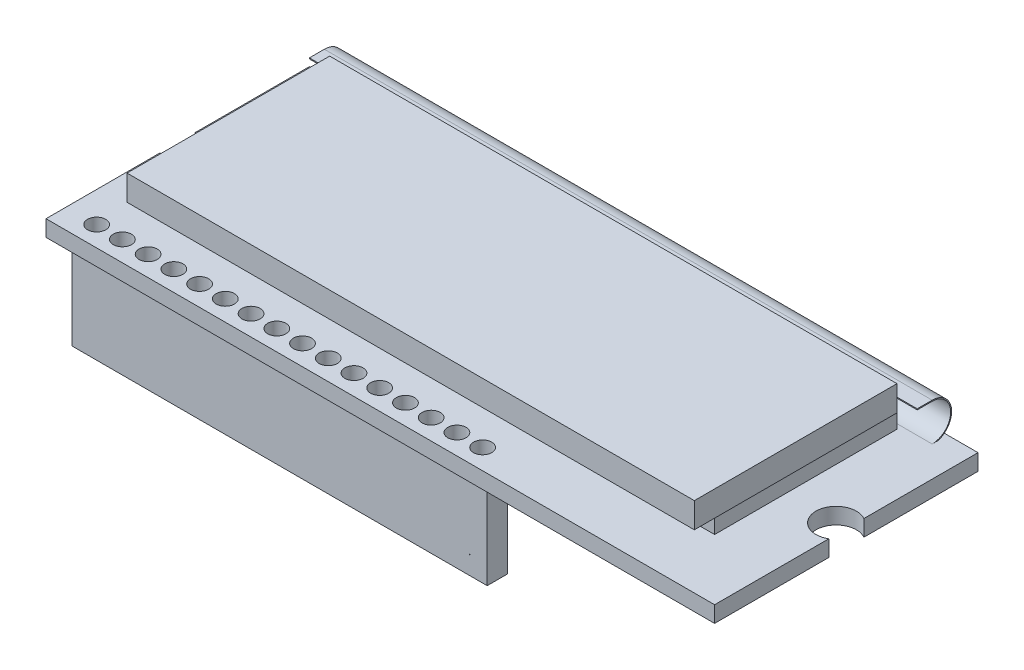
ISO-10303-21;
HEADER;
FILE_DESCRIPTION(('STEP AP214'),'2;1');
FILE_NAME('part.step','',(''),(''),'','','');
FILE_SCHEMA(('AUTOMOTIVE_DESIGN { 1 0 10303 214 1 1 1 1 }'));
ENDSEC;
DATA;
#1=APPLICATION_CONTEXT('core data for automotive mechanical design processes');
#2=APPLICATION_PROTOCOL_DEFINITION('international standard','automotive_design',2000,#1);
#3=PRODUCT_CONTEXT('',#1,'mechanical');
#4=PRODUCT('Part','Part','',(#3));
#5=PRODUCT_RELATED_PRODUCT_CATEGORY('part','',(#4));
#6=PRODUCT_DEFINITION_FORMATION('','',#4);
#7=PRODUCT_DEFINITION_CONTEXT('part definition',#1,'design');
#8=PRODUCT_DEFINITION('design','',#6,#7);
#9=PRODUCT_DEFINITION_SHAPE('','',#8);
#10=(LENGTH_UNIT() NAMED_UNIT(*) SI_UNIT(.MILLI.,.METRE.));
#11=(NAMED_UNIT(*) PLANE_ANGLE_UNIT() SI_UNIT($,.RADIAN.));
#12=(NAMED_UNIT(*) SI_UNIT($,.STERADIAN.) SOLID_ANGLE_UNIT());
#13=UNCERTAINTY_MEASURE_WITH_UNIT(LENGTH_MEASURE(1.E-05),#10,'distance_accuracy_value','');
#14=(GEOMETRIC_REPRESENTATION_CONTEXT(3) GLOBAL_UNCERTAINTY_ASSIGNED_CONTEXT((#13)) GLOBAL_UNIT_ASSIGNED_CONTEXT((#10,
#11,#12)) REPRESENTATION_CONTEXT('',''));
#15=CARTESIAN_POINT('',(0.,0.,0.));
#16=DIRECTION('',(0.,0.,1.));
#17=DIRECTION('',(1.,0.,0.));
#18=AXIS2_PLACEMENT_3D('',#15,#16,#17);
#19=CARTESIAN_POINT('',(0.,0.,0.));
#20=DIRECTION('',(0.,1.,0.));
#21=DIRECTION('',(0.,0.,1.));
#22=AXIS2_PLACEMENT_3D('',#19,#20,#21);
#23=PLANE('',#22);
#24=DIRECTION('',(0.,0.,1.));
#25=VECTOR('',#24,1.);
#26=CARTESIAN_POINT('',(-33.,0.,13.));
#27=LINE('',#26,#25);
#28=CARTESIAN_POINT('',(-33.,0.,1.73205080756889));
#29=VERTEX_POINT('',#28);
#30=CARTESIAN_POINT('',(-33.,0.,13.));
#31=VERTEX_POINT('',#30);
#32=EDGE_CURVE('E432',#29,#31,#27,.T.);
#33=ORIENTED_EDGE('',*,*,#32,.F.);
#34=CARTESIAN_POINT('',(-32.,0.,0.));
#35=DIRECTION('',(0.,1.,0.));
#36=DIRECTION('',(0.,0.,1.));
#37=AXIS2_PLACEMENT_3D('',#34,#35,#36);
#38=CIRCLE('',#37,2.);
#39=CARTESIAN_POINT('',(-33.,0.,-1.73205080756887));
#40=VERTEX_POINT('',#39);
#41=EDGE_CURVE('E471',#29,#40,#38,.T.);
#42=ORIENTED_EDGE('',*,*,#41,.T.);
#43=CARTESIAN_POINT('',(-33.,0.,-13.));
#44=VERTEX_POINT('',#43);
#45=EDGE_CURVE('E446',#44,#40,#27,.T.);
#46=ORIENTED_EDGE('',*,*,#45,.F.);
#47=DIRECTION('',(-1.,0.,0.));
#48=VECTOR('',#47,1.);
#49=CARTESIAN_POINT('',(33.,0.,-13.));
#50=LINE('',#49,#48);
#51=CARTESIAN_POINT('',(33.,0.,-13.));
#52=VERTEX_POINT('',#51);
#53=EDGE_CURVE('E455',#52,#44,#50,.T.);
#54=ORIENTED_EDGE('',*,*,#53,.F.);
#55=DIRECTION('',(0.,0.,-1.));
#56=VECTOR('',#55,1.);
#57=CARTESIAN_POINT('',(33.,0.,13.));
#58=LINE('',#57,#56);
#59=CARTESIAN_POINT('',(33.,0.,-1.73205080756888));
#60=VERTEX_POINT('',#59);
#61=EDGE_CURVE('E451',#60,#52,#58,.T.);
#62=ORIENTED_EDGE('',*,*,#61,.F.);
#63=CARTESIAN_POINT('',(32.,0.,0.));
#64=DIRECTION('',(0.,1.,0.));
#65=DIRECTION('',(0.,0.,1.));
#66=AXIS2_PLACEMENT_3D('',#63,#64,#65);
#67=CIRCLE('',#66,2.);
#68=CARTESIAN_POINT('',(33.,0.,1.73205080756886));
#69=VERTEX_POINT('',#68);
#70=EDGE_CURVE('E468',#60,#69,#67,.T.);
#71=ORIENTED_EDGE('',*,*,#70,.T.);
#72=CARTESIAN_POINT('',(33.,0.,13.));
#73=VERTEX_POINT('',#72);
#74=EDGE_CURVE('E452',#73,#69,#58,.T.);
#75=ORIENTED_EDGE('',*,*,#74,.F.);
#76=DIRECTION('',(1.,0.,0.));
#77=VECTOR('',#76,1.);
#78=CARTESIAN_POINT('',(33.,0.,13.));
#79=LINE('',#78,#77);
#80=EDGE_CURVE('E449',#31,#73,#79,.T.);
#81=ORIENTED_EDGE('',*,*,#80,.F.);
#82=EDGE_LOOP('',(#33,#42,#46,#54,#62,#71,#75,#81));
#83=FACE_BOUND('',#82,.T.);
#84=DIRECTION('',(0.,0.,-1.));
#85=VECTOR('',#84,1.);
#86=CARTESIAN_POINT('',(-31.45,0.,10.));
#87=LINE('',#86,#85);
#88=CARTESIAN_POINT('',(-31.45,0.,12.));
#89=VERTEX_POINT('',#88);
#90=CARTESIAN_POINT('',(-31.45,0.,10.));
#91=VERTEX_POINT('',#90);
#92=EDGE_CURVE('E247',#89,#91,#87,.T.);
#93=ORIENTED_EDGE('',*,*,#92,.F.);
#94=DIRECTION('',(-1.,0.,0.));
#95=VECTOR('',#94,1.);
#96=CARTESIAN_POINT('',(9.55000000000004,0.,12.));
#97=LINE('',#96,#95);
#98=CARTESIAN_POINT('',(9.55000000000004,0.,12.));
#99=VERTEX_POINT('',#98);
#100=EDGE_CURVE('E244',#99,#89,#97,.T.);
#101=ORIENTED_EDGE('',*,*,#100,.F.);
#102=DIRECTION('',(0.,0.,1.));
#103=VECTOR('',#102,1.);
#104=CARTESIAN_POINT('',(9.55000000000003,0.,10.));
#105=LINE('',#104,#103);
#106=CARTESIAN_POINT('',(9.55000000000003,0.,10.));
#107=VERTEX_POINT('',#106);
#108=EDGE_CURVE('E57',#107,#99,#105,.T.);
#109=ORIENTED_EDGE('',*,*,#108,.F.);
#110=DIRECTION('',(1.,0.,0.));
#111=VECTOR('',#110,1.);
#112=CARTESIAN_POINT('',(9.55000000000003,0.,10.));
#113=LINE('',#112,#111);
#114=EDGE_CURVE('E52',#91,#107,#113,.T.);
#115=ORIENTED_EDGE('',*,*,#114,.F.);
#116=EDGE_LOOP('',(#93,#101,#109,#115));
#117=FACE_BOUND('',#116,.T.);
#118=ADVANCED_FACE('F37',(#83,#117),#23,.F.);
#119=CARTESIAN_POINT('',(0.,1.6,0.));
#120=DIRECTION('',(0.,1.,0.));
#121=DIRECTION('',(0.,0.,1.));
#122=AXIS2_PLACEMENT_3D('',#119,#120,#121);
#123=PLANE('',#122);
#124=CARTESIAN_POINT('',(-30.,1.6,11.));
#125=DIRECTION('',(0.,1.,0.));
#126=DIRECTION('',(0.,0.,1.));
#127=AXIS2_PLACEMENT_3D('',#124,#125,#126);
#128=CIRCLE('',#127,0.9);
#129=CARTESIAN_POINT('',(-30.,1.6,11.9));
#130=VERTEX_POINT('',#129);
#131=EDGE_CURVE('E257',#130,#130,#128,.T.);
#132=ORIENTED_EDGE('',*,*,#131,.F.);
#133=EDGE_LOOP('',(#132));
#134=FACE_BOUND('',#133,.T.);
#135=CARTESIAN_POINT('',(-27.46,1.6,11.));
#136=DIRECTION('',(0.,1.,0.));
#137=DIRECTION('',(0.,0.,1.));
#138=AXIS2_PLACEMENT_3D('',#135,#136,#137);
#139=CIRCLE('',#138,0.9);
#140=CARTESIAN_POINT('',(-27.46,1.6,11.9));
#141=VERTEX_POINT('',#140);
#142=EDGE_CURVE('E261',#141,#141,#139,.T.);
#143=ORIENTED_EDGE('',*,*,#142,.F.);
#144=EDGE_LOOP('',(#143));
#145=FACE_BOUND('',#144,.T.);
#146=CARTESIAN_POINT('',(-24.92,1.6,11.));
#147=DIRECTION('',(0.,1.,0.));
#148=DIRECTION('',(0.,0.,1.));
#149=AXIS2_PLACEMENT_3D('',#146,#147,#148);
#150=CIRCLE('',#149,0.9);
#151=CARTESIAN_POINT('',(-24.92,1.6,11.9));
#152=VERTEX_POINT('',#151);
#153=EDGE_CURVE('E264',#152,#152,#150,.T.);
#154=ORIENTED_EDGE('',*,*,#153,.F.);
#155=EDGE_LOOP('',(#154));
#156=FACE_BOUND('',#155,.T.);
#157=CARTESIAN_POINT('',(-22.38,1.6,11.));
#158=DIRECTION('',(0.,1.,0.));
#159=DIRECTION('',(0.,0.,1.));
#160=AXIS2_PLACEMENT_3D('',#157,#158,#159);
#161=CIRCLE('',#160,0.900000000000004);
#162=CARTESIAN_POINT('',(-22.38,1.6,11.9));
#163=VERTEX_POINT('',#162);
#164=EDGE_CURVE('E267',#163,#163,#161,.T.);
#165=ORIENTED_EDGE('',*,*,#164,.F.);
#166=EDGE_LOOP('',(#165));
#167=FACE_BOUND('',#166,.T.);
#168=CARTESIAN_POINT('',(-19.84,1.6,11.));
#169=DIRECTION('',(0.,1.,0.));
#170=DIRECTION('',(0.,0.,1.));
#171=AXIS2_PLACEMENT_3D('',#168,#169,#170);
#172=CIRCLE('',#171,0.900000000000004);
#173=CARTESIAN_POINT('',(-19.84,1.6,11.9));
#174=VERTEX_POINT('',#173);
#175=EDGE_CURVE('E270',#174,#174,#172,.T.);
#176=ORIENTED_EDGE('',*,*,#175,.F.);
#177=EDGE_LOOP('',(#176));
#178=FACE_BOUND('',#177,.T.);
#179=CARTESIAN_POINT('',(-17.3,1.6,11.));
#180=DIRECTION('',(0.,1.,0.));
#181=DIRECTION('',(0.,0.,1.));
#182=AXIS2_PLACEMENT_3D('',#179,#180,#181);
#183=CIRCLE('',#182,0.900000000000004);
#184=CARTESIAN_POINT('',(-17.3,1.6,11.9));
#185=VERTEX_POINT('',#184);
#186=EDGE_CURVE('E273',#185,#185,#183,.T.);
#187=ORIENTED_EDGE('',*,*,#186,.F.);
#188=EDGE_LOOP('',(#187));
#189=FACE_BOUND('',#188,.T.);
#190=CARTESIAN_POINT('',(-14.76,1.6,11.));
#191=DIRECTION('',(0.,1.,0.));
#192=DIRECTION('',(0.,0.,1.));
#193=AXIS2_PLACEMENT_3D('',#190,#191,#192);
#194=CIRCLE('',#193,0.9);
#195=CARTESIAN_POINT('',(-14.76,1.6,11.9));
#196=VERTEX_POINT('',#195);
#197=EDGE_CURVE('E276',#196,#196,#194,.T.);
#198=ORIENTED_EDGE('',*,*,#197,.F.);
#199=EDGE_LOOP('',(#198));
#200=FACE_BOUND('',#199,.T.);
#201=CARTESIAN_POINT('',(-12.22,1.6,11.));
#202=DIRECTION('',(0.,1.,0.));
#203=DIRECTION('',(0.,0.,1.));
#204=AXIS2_PLACEMENT_3D('',#201,#202,#203);
#205=CIRCLE('',#204,0.9);
#206=CARTESIAN_POINT('',(-12.22,1.6,11.9));
#207=VERTEX_POINT('',#206);
#208=EDGE_CURVE('E279',#207,#207,#205,.T.);
#209=ORIENTED_EDGE('',*,*,#208,.F.);
#210=EDGE_LOOP('',(#209));
#211=FACE_BOUND('',#210,.T.);
#212=CARTESIAN_POINT('',(-9.67999999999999,1.6,11.));
#213=DIRECTION('',(0.,1.,0.));
#214=DIRECTION('',(0.,0.,1.));
#215=AXIS2_PLACEMENT_3D('',#212,#213,#214);
#216=CIRCLE('',#215,0.9);
#217=CARTESIAN_POINT('',(-9.67999999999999,1.6,11.9));
#218=VERTEX_POINT('',#217);
#219=EDGE_CURVE('E282',#218,#218,#216,.T.);
#220=ORIENTED_EDGE('',*,*,#219,.F.);
#221=EDGE_LOOP('',(#220));
#222=FACE_BOUND('',#221,.T.);
#223=CARTESIAN_POINT('',(-7.13999999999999,1.6,11.));
#224=DIRECTION('',(0.,1.,0.));
#225=DIRECTION('',(0.,0.,1.));
#226=AXIS2_PLACEMENT_3D('',#223,#224,#225);
#227=CIRCLE('',#226,0.9);
#228=CARTESIAN_POINT('',(-7.13999999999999,1.6,11.9));
#229=VERTEX_POINT('',#228);
#230=EDGE_CURVE('E285',#229,#229,#227,.T.);
#231=ORIENTED_EDGE('',*,*,#230,.F.);
#232=EDGE_LOOP('',(#231));
#233=FACE_BOUND('',#232,.T.);
#234=CARTESIAN_POINT('',(-4.59999999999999,1.6,11.));
#235=DIRECTION('',(0.,1.,0.));
#236=DIRECTION('',(0.,0.,1.));
#237=AXIS2_PLACEMENT_3D('',#234,#235,#236);
#238=CIRCLE('',#237,0.9);
#239=CARTESIAN_POINT('',(-4.59999999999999,1.6,11.9));
#240=VERTEX_POINT('',#239);
#241=EDGE_CURVE('E288',#240,#240,#238,.T.);
#242=ORIENTED_EDGE('',*,*,#241,.F.);
#243=EDGE_LOOP('',(#242));
#244=FACE_BOUND('',#243,.T.);
#245=CARTESIAN_POINT('',(-2.05999999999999,1.6,11.));
#246=DIRECTION('',(0.,1.,0.));
#247=DIRECTION('',(0.,0.,1.));
#248=AXIS2_PLACEMENT_3D('',#245,#246,#247);
#249=CIRCLE('',#248,0.9);
#250=CARTESIAN_POINT('',(-2.05999999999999,1.6,11.9));
#251=VERTEX_POINT('',#250);
#252=EDGE_CURVE('E291',#251,#251,#249,.T.);
#253=ORIENTED_EDGE('',*,*,#252,.F.);
#254=EDGE_LOOP('',(#253));
#255=FACE_BOUND('',#254,.T.);
#256=CARTESIAN_POINT('',(0.480000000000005,1.6,11.));
#257=DIRECTION('',(0.,1.,0.));
#258=DIRECTION('',(0.,0.,1.));
#259=AXIS2_PLACEMENT_3D('',#256,#257,#258);
#260=CIRCLE('',#259,0.9);
#261=CARTESIAN_POINT('',(0.480000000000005,1.6,11.9));
#262=VERTEX_POINT('',#261);
#263=EDGE_CURVE('E294',#262,#262,#260,.T.);
#264=ORIENTED_EDGE('',*,*,#263,.F.);
#265=EDGE_LOOP('',(#264));
#266=FACE_BOUND('',#265,.T.);
#267=CARTESIAN_POINT('',(3.02000000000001,1.6,11.));
#268=DIRECTION('',(0.,1.,0.));
#269=DIRECTION('',(0.,0.,1.));
#270=AXIS2_PLACEMENT_3D('',#267,#268,#269);
#271=CIRCLE('',#270,0.9);
#272=CARTESIAN_POINT('',(3.02000000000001,1.6,11.9));
#273=VERTEX_POINT('',#272);
#274=EDGE_CURVE('E297',#273,#273,#271,.T.);
#275=ORIENTED_EDGE('',*,*,#274,.F.);
#276=EDGE_LOOP('',(#275));
#277=FACE_BOUND('',#276,.T.);
#278=CARTESIAN_POINT('',(5.56000000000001,1.6,11.));
#279=DIRECTION('',(0.,1.,0.));
#280=DIRECTION('',(0.,0.,1.));
#281=AXIS2_PLACEMENT_3D('',#278,#279,#280);
#282=CIRCLE('',#281,0.9);
#283=CARTESIAN_POINT('',(5.56000000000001,1.6,11.9));
#284=VERTEX_POINT('',#283);
#285=EDGE_CURVE('E251',#284,#284,#282,.T.);
#286=ORIENTED_EDGE('',*,*,#285,.F.);
#287=EDGE_LOOP('',(#286));
#288=FACE_BOUND('',#287,.T.);
#289=CARTESIAN_POINT('',(8.10000000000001,1.6,11.));
#290=DIRECTION('',(0.,1.,0.));
#291=DIRECTION('',(0.,0.,1.));
#292=AXIS2_PLACEMENT_3D('',#289,#290,#291);
#293=CIRCLE('',#292,0.9);
#294=CARTESIAN_POINT('',(8.10000000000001,1.6,11.9));
#295=VERTEX_POINT('',#294);
#296=EDGE_CURVE('E248',#295,#295,#293,.T.);
#297=ORIENTED_EDGE('',*,*,#296,.F.);
#298=EDGE_LOOP('',(#297));
#299=FACE_BOUND('',#298,.T.);
#300=DIRECTION('',(0.,0.,1.));
#301=VECTOR('',#300,1.);
#302=CARTESIAN_POINT('',(-27.,1.6,7.00000000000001));
#303=LINE('',#302,#301);
#304=CARTESIAN_POINT('',(-27.,1.6,-11.));
#305=VERTEX_POINT('',#304);
#306=CARTESIAN_POINT('',(-27.,1.6,7.00000000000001));
#307=VERTEX_POINT('',#306);
#308=EDGE_CURVE('E380',#305,#307,#303,.T.);
#309=ORIENTED_EDGE('',*,*,#308,.F.);
#310=DIRECTION('',(-1.,0.,0.));
#311=VECTOR('',#310,1.);
#312=CARTESIAN_POINT('',(27.,1.6,-11.));
#313=LINE('',#312,#311);
#314=CARTESIAN_POINT('',(27.,1.6,-11.));
#315=VERTEX_POINT('',#314);
#316=EDGE_CURVE('E402',#315,#305,#313,.T.);
#317=ORIENTED_EDGE('',*,*,#316,.F.);
#318=DIRECTION('',(0.,0.,-1.));
#319=VECTOR('',#318,1.);
#320=CARTESIAN_POINT('',(27.,1.6,7.));
#321=LINE('',#320,#319);
#322=CARTESIAN_POINT('',(27.,1.6,7.));
#323=VERTEX_POINT('',#322);
#324=EDGE_CURVE('E399',#323,#315,#321,.T.);
#325=ORIENTED_EDGE('',*,*,#324,.F.);
#326=DIRECTION('',(1.,0.,0.));
#327=VECTOR('',#326,1.);
#328=CARTESIAN_POINT('',(27.,1.6,7.));
#329=LINE('',#328,#327);
#330=EDGE_CURVE('E396',#307,#323,#329,.T.);
#331=ORIENTED_EDGE('',*,*,#330,.F.);
#332=EDGE_LOOP('',(#309,#317,#325,#331));
#333=FACE_BOUND('',#332,.T.);
#334=CARTESIAN_POINT('',(-32.,1.6,0.));
#335=DIRECTION('',(0.,1.,0.));
#336=DIRECTION('',(0.,0.,1.));
#337=AXIS2_PLACEMENT_3D('',#334,#335,#336);
#338=CIRCLE('',#337,2.);
#339=CARTESIAN_POINT('',(-33.,1.6,1.73205080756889));
#340=VERTEX_POINT('',#339);
#341=CARTESIAN_POINT('',(-33.,1.6,-1.73205080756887));
#342=VERTEX_POINT('',#341);
#343=EDGE_CURVE('E417',#340,#342,#338,.T.);
#344=ORIENTED_EDGE('',*,*,#343,.F.);
#345=DIRECTION('',(0.,0.,1.));
#346=VECTOR('',#345,1.);
#347=CARTESIAN_POINT('',(-33.,1.6,13.));
#348=LINE('',#347,#346);
#349=CARTESIAN_POINT('',(-33.,1.6,13.));
#350=VERTEX_POINT('',#349);
#351=EDGE_CURVE('E437',#340,#350,#348,.T.);
#352=ORIENTED_EDGE('',*,*,#351,.T.);
#353=DIRECTION('',(1.,0.,0.));
#354=VECTOR('',#353,1.);
#355=CARTESIAN_POINT('',(33.,1.6,13.));
#356=LINE('',#355,#354);
#357=CARTESIAN_POINT('',(33.,1.6,13.));
#358=VERTEX_POINT('',#357);
#359=EDGE_CURVE('E436',#350,#358,#356,.T.);
#360=ORIENTED_EDGE('',*,*,#359,.T.);
#361=DIRECTION('',(0.,0.,-1.));
#362=VECTOR('',#361,1.);
#363=CARTESIAN_POINT('',(33.,1.6,13.));
#364=LINE('',#363,#362);
#365=CARTESIAN_POINT('',(33.,1.6,1.73205080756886));
#366=VERTEX_POINT('',#365);
#367=EDGE_CURVE('E440',#358,#366,#364,.T.);
#368=ORIENTED_EDGE('',*,*,#367,.T.);
#369=CARTESIAN_POINT('',(32.,1.6,0.));
#370=DIRECTION('',(0.,1.,0.));
#371=DIRECTION('',(0.,0.,1.));
#372=AXIS2_PLACEMENT_3D('',#369,#370,#371);
#373=CIRCLE('',#372,2.);
#374=CARTESIAN_POINT('',(33.,1.6,-1.73205080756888));
#375=VERTEX_POINT('',#374);
#376=EDGE_CURVE('E416',#375,#366,#373,.T.);
#377=ORIENTED_EDGE('',*,*,#376,.F.);
#378=CARTESIAN_POINT('',(33.,1.6,-13.));
#379=VERTEX_POINT('',#378);
#380=EDGE_CURVE('E439',#375,#379,#364,.T.);
#381=ORIENTED_EDGE('',*,*,#380,.T.);
#382=DIRECTION('',(-1.,0.,0.));
#383=VECTOR('',#382,1.);
#384=CARTESIAN_POINT('',(33.,1.6,-13.));
#385=LINE('',#384,#383);
#386=CARTESIAN_POINT('',(-33.,1.6,-13.));
#387=VERTEX_POINT('',#386);
#388=EDGE_CURVE('E443',#379,#387,#385,.T.);
#389=ORIENTED_EDGE('',*,*,#388,.T.);
#390=EDGE_CURVE('E433',#387,#342,#348,.T.);
#391=ORIENTED_EDGE('',*,*,#390,.T.);
#392=EDGE_LOOP('',(#344,#352,#360,#368,#377,#381,#389,#391));
#393=FACE_BOUND('',#392,.T.);
#394=DIRECTION('',(1.,0.,0.));
#395=VECTOR('',#394,1.);
#396=CARTESIAN_POINT('',(-30.,1.6,-11.475));
#397=LINE('',#396,#395);
#398=CARTESIAN_POINT('',(-30.,1.6,-11.475));
#399=VERTEX_POINT('',#398);
#400=CARTESIAN_POINT('',(30.,1.6,-11.475));
#401=VERTEX_POINT('',#400);
#402=EDGE_CURVE('E331',#399,#401,#397,.T.);
#403=ORIENTED_EDGE('',*,*,#402,.F.);
#404=DIRECTION('',(0.,0.,-1.));
#405=VECTOR('',#404,1.);
#406=CARTESIAN_POINT('',(-30.,1.6,0.));
#407=LINE('',#406,#405);
#408=CARTESIAN_POINT('',(-30.,1.6,-12.0873724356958));
#409=VERTEX_POINT('',#408);
#410=EDGE_CURVE('E11',#399,#409,#407,.T.);
#411=ORIENTED_EDGE('',*,*,#410,.T.);
#412=DIRECTION('',(1.,0.,0.));
#413=VECTOR('',#412,1.);
#414=CARTESIAN_POINT('',(-30.,1.6,-12.0873724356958));
#415=LINE('',#414,#413);
#416=CARTESIAN_POINT('',(30.,1.6,-12.0873724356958));
#417=VERTEX_POINT('',#416);
#418=EDGE_CURVE('E45',#417,#409,#415,.F.);
#419=ORIENTED_EDGE('',*,*,#418,.F.);
#420=DIRECTION('',(0.,0.,-1.));
#421=VECTOR('',#420,1.);
#422=CARTESIAN_POINT('',(30.,1.6,0.));
#423=LINE('',#422,#421);
#424=EDGE_CURVE('E479',#401,#417,#423,.T.);
#425=ORIENTED_EDGE('',*,*,#424,.F.);
#426=EDGE_LOOP('',(#403,#411,#419,#425));
#427=FACE_BOUND('',#426,.T.);
#428=ADVANCED_FACE('F516',(#134,#145,#156,#167,#178,#189,#200,#211,#222,#233,#244,#255,#266,
#277,#288,#299,#333,#393,#427),#123,.T.);
#429=CARTESIAN_POINT('',(28.,6.5,-10.));
#430=DIRECTION('',(0.,0.,1.));
#431=DIRECTION('',(1.,0.,0.));
#432=AXIS2_PLACEMENT_3D('',#429,#430,#431);
#433=PLANE('',#432);
#434=DIRECTION('',(-1.,0.,0.));
#435=VECTOR('',#434,1.);
#436=CARTESIAN_POINT('',(28.,5.25,-10.));
#437=LINE('',#436,#435);
#438=CARTESIAN_POINT('',(28.,5.25,-10.));
#439=VERTEX_POINT('',#438);
#440=CARTESIAN_POINT('',(-28.,5.25,-10.));
#441=VERTEX_POINT('',#440);
#442=EDGE_CURVE('E474',#439,#441,#437,.T.);
#443=ORIENTED_EDGE('',*,*,#442,.F.);
#444=DIRECTION('',(0.,-1.,0.));
#445=VECTOR('',#444,1.);
#446=CARTESIAN_POINT('',(28.,6.5,-10.));
#447=LINE('',#446,#445);
#448=CARTESIAN_POINT('',(28.,4.,-10.));
#449=VERTEX_POINT('',#448);
#450=EDGE_CURVE('E368',#439,#449,#447,.T.);
#451=ORIENTED_EDGE('',*,*,#450,.T.);
#452=DIRECTION('',(-1.,0.,0.));
#453=VECTOR('',#452,1.);
#454=CARTESIAN_POINT('',(28.,4.,-10.));
#455=LINE('',#454,#453);
#456=CARTESIAN_POINT('',(27.,4.,-10.));
#457=VERTEX_POINT('',#456);
#458=EDGE_CURVE('E347',#449,#457,#455,.T.);
#459=ORIENTED_EDGE('',*,*,#458,.T.);
#460=CARTESIAN_POINT('',(-27.,4.,-9.99999999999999));
#461=VERTEX_POINT('',#460);
#462=EDGE_CURVE('E364',#457,#461,#455,.T.);
#463=ORIENTED_EDGE('',*,*,#462,.T.);
#464=CARTESIAN_POINT('',(-28.,4.,-9.99999999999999));
#465=VERTEX_POINT('',#464);
#466=EDGE_CURVE('E361',#461,#465,#455,.T.);
#467=ORIENTED_EDGE('',*,*,#466,.T.);
#468=DIRECTION('',(0.,-1.,0.));
#469=VECTOR('',#468,1.);
#470=CARTESIAN_POINT('',(-28.,6.5,-9.99999999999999));
#471=LINE('',#470,#469);
#472=EDGE_CURVE('E353',#441,#465,#471,.T.);
#473=ORIENTED_EDGE('',*,*,#472,.F.);
#474=EDGE_LOOP('',(#443,#451,#459,#463,#467,#473));
#475=FACE_BOUND('',#474,.T.);
#476=ADVANCED_FACE('F518',(#475),#433,.F.);
#477=CARTESIAN_POINT('',(-33.,1.6,13.));
#478=DIRECTION('',(1.,0.,0.));
#479=DIRECTION('',(0.,0.,-1.));
#480=AXIS2_PLACEMENT_3D('',#477,#478,#479);
#481=PLANE('',#480);
#482=ORIENTED_EDGE('',*,*,#45,.T.);
#483=DIRECTION('',(0.,1.,0.));
#484=VECTOR('',#483,1.);
#485=CARTESIAN_POINT('',(-33.,0.,-1.73205080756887));
#486=LINE('',#485,#484);
#487=EDGE_CURVE('E429',#40,#342,#486,.T.);
#488=ORIENTED_EDGE('',*,*,#487,.T.);
#489=ORIENTED_EDGE('',*,*,#390,.F.);
#490=DIRECTION('',(0.,-1.,0.));
#491=VECTOR('',#490,1.);
#492=CARTESIAN_POINT('',(-33.,1.6,-13.));
#493=LINE('',#492,#491);
#494=EDGE_CURVE('E445',#387,#44,#493,.T.);
#495=ORIENTED_EDGE('',*,*,#494,.T.);
#496=EDGE_LOOP('',(#482,#488,#489,#495));
#497=FACE_BOUND('',#496,.T.);
#498=ADVANCED_FACE('F525',(#497),#481,.F.);
#499=CARTESIAN_POINT('',(33.,1.6,13.));
#500=DIRECTION('',(-1.,0.,0.));
#501=DIRECTION('',(0.,0.,1.));
#502=AXIS2_PLACEMENT_3D('',#499,#500,#501);
#503=PLANE('',#502);
#504=ORIENTED_EDGE('',*,*,#74,.T.);
#505=DIRECTION('',(0.,1.,0.));
#506=VECTOR('',#505,1.);
#507=CARTESIAN_POINT('',(33.,0.,1.73205080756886));
#508=LINE('',#507,#506);
#509=EDGE_CURVE('E423',#69,#366,#508,.T.);
#510=ORIENTED_EDGE('',*,*,#509,.T.);
#511=ORIENTED_EDGE('',*,*,#367,.F.);
#512=DIRECTION('',(0.,-1.,0.));
#513=VECTOR('',#512,1.);
#514=CARTESIAN_POINT('',(33.,1.6,13.));
#515=LINE('',#514,#513);
#516=EDGE_CURVE('E462',#358,#73,#515,.T.);
#517=ORIENTED_EDGE('',*,*,#516,.T.);
#518=EDGE_LOOP('',(#504,#510,#511,#517));
#519=FACE_BOUND('',#518,.T.);
#520=ADVANCED_FACE('F545',(#519),#503,.F.);
#521=ORIENTED_EDGE('',*,*,#351,.F.);
#522=DIRECTION('',(0.,1.,0.));
#523=VECTOR('',#522,1.);
#524=CARTESIAN_POINT('',(-33.,0.,1.73205080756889));
#525=LINE('',#524,#523);
#526=EDGE_CURVE('E426',#340,#29,#525,.F.);
#527=ORIENTED_EDGE('',*,*,#526,.T.);
#528=ORIENTED_EDGE('',*,*,#32,.T.);
#529=DIRECTION('',(0.,-1.,0.));
#530=VECTOR('',#529,1.);
#531=CARTESIAN_POINT('',(-33.,1.6,13.));
#532=LINE('',#531,#530);
#533=EDGE_CURVE('E465',#350,#31,#532,.T.);
#534=ORIENTED_EDGE('',*,*,#533,.F.);
#535=EDGE_LOOP('',(#521,#527,#528,#534));
#536=FACE_BOUND('',#535,.T.);
#537=ADVANCED_FACE('F39',(#536),#481,.F.);
#538=CARTESIAN_POINT('',(33.,1.6,13.));
#539=DIRECTION('',(0.,0.,-1.));
#540=DIRECTION('',(-1.,0.,0.));
#541=AXIS2_PLACEMENT_3D('',#538,#539,#540);
#542=PLANE('',#541);
#543=ORIENTED_EDGE('',*,*,#80,.T.);
#544=ORIENTED_EDGE('',*,*,#516,.F.);
#545=ORIENTED_EDGE('',*,*,#359,.F.);
#546=ORIENTED_EDGE('',*,*,#533,.T.);
#547=EDGE_LOOP('',(#543,#544,#545,#546));
#548=FACE_BOUND('',#547,.T.);
#549=ADVANCED_FACE('F543',(#548),#542,.F.);
#550=ORIENTED_EDGE('',*,*,#380,.F.);
#551=DIRECTION('',(0.,1.,0.));
#552=VECTOR('',#551,1.);
#553=CARTESIAN_POINT('',(33.,0.,-1.73205080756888));
#554=LINE('',#553,#552);
#555=EDGE_CURVE('E419',#375,#60,#554,.F.);
#556=ORIENTED_EDGE('',*,*,#555,.T.);
#557=ORIENTED_EDGE('',*,*,#61,.T.);
#558=DIRECTION('',(0.,-1.,0.));
#559=VECTOR('',#558,1.);
#560=CARTESIAN_POINT('',(33.,1.6,-13.));
#561=LINE('',#560,#559);
#562=EDGE_CURVE('E459',#379,#52,#561,.T.);
#563=ORIENTED_EDGE('',*,*,#562,.F.);
#564=EDGE_LOOP('',(#550,#556,#557,#563));
#565=FACE_BOUND('',#564,.T.);
#566=ADVANCED_FACE('F540',(#565),#503,.F.);
#567=CARTESIAN_POINT('',(33.,1.6,-13.));
#568=DIRECTION('',(0.,0.,1.));
#569=DIRECTION('',(1.,0.,0.));
#570=AXIS2_PLACEMENT_3D('',#567,#568,#569);
#571=PLANE('',#570);
#572=ORIENTED_EDGE('',*,*,#53,.T.);
#573=ORIENTED_EDGE('',*,*,#494,.F.);
#574=ORIENTED_EDGE('',*,*,#388,.F.);
#575=ORIENTED_EDGE('',*,*,#562,.T.);
#576=EDGE_LOOP('',(#572,#573,#574,#575));
#577=FACE_BOUND('',#576,.T.);
#578=ADVANCED_FACE('F537',(#577),#571,.F.);
#579=CARTESIAN_POINT('',(32.,0.,0.));
#580=DIRECTION('',(0.,1.,0.));
#581=DIRECTION('',(0.,0.,1.));
#582=AXIS2_PLACEMENT_3D('',#579,#580,#581);
#583=CYLINDRICAL_SURFACE('',#582,2.);
#584=ORIENTED_EDGE('',*,*,#70,.F.);
#585=ORIENTED_EDGE('',*,*,#555,.F.);
#586=ORIENTED_EDGE('',*,*,#376,.T.);
#587=ORIENTED_EDGE('',*,*,#509,.F.);
#588=EDGE_LOOP('',(#584,#585,#586,#587));
#589=FACE_BOUND('',#588,.T.);
#590=ADVANCED_FACE('F534',(#589),#583,.F.);
#591=CARTESIAN_POINT('',(-32.,0.,0.));
#592=DIRECTION('',(0.,1.,0.));
#593=DIRECTION('',(0.,0.,1.));
#594=AXIS2_PLACEMENT_3D('',#591,#592,#593);
#595=CYLINDRICAL_SURFACE('',#594,2.);
#596=ORIENTED_EDGE('',*,*,#41,.F.);
#597=ORIENTED_EDGE('',*,*,#526,.F.);
#598=ORIENTED_EDGE('',*,*,#343,.T.);
#599=ORIENTED_EDGE('',*,*,#487,.F.);
#600=EDGE_LOOP('',(#596,#597,#598,#599));
#601=FACE_BOUND('',#600,.T.);
#602=ADVANCED_FACE('F575',(#601),#595,.F.);
#603=CARTESIAN_POINT('',(-27.,4.,7.00000000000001));
#604=DIRECTION('',(1.,0.,0.));
#605=DIRECTION('',(0.,0.,-1.));
#606=AXIS2_PLACEMENT_3D('',#603,#604,#605);
#607=PLANE('',#606);
#608=ORIENTED_EDGE('',*,*,#308,.T.);
#609=DIRECTION('',(0.,-1.,0.));
#610=VECTOR('',#609,1.);
#611=CARTESIAN_POINT('',(-27.,4.,7.00000000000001));
#612=LINE('',#611,#610);
#613=CARTESIAN_POINT('',(-27.,4.,7.00000000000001));
#614=VERTEX_POINT('',#613);
#615=EDGE_CURVE('E413',#614,#307,#612,.T.);
#616=ORIENTED_EDGE('',*,*,#615,.F.);
#617=DIRECTION('',(0.,0.,1.));
#618=VECTOR('',#617,1.);
#619=CARTESIAN_POINT('',(-27.,4.,7.00000000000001));
#620=LINE('',#619,#618);
#621=EDGE_CURVE('E384',#461,#614,#620,.T.);
#622=ORIENTED_EDGE('',*,*,#621,.F.);
#623=CARTESIAN_POINT('',(-27.,4.,-11.));
#624=VERTEX_POINT('',#623);
#625=EDGE_CURVE('E381',#624,#461,#620,.T.);
#626=ORIENTED_EDGE('',*,*,#625,.F.);
#627=DIRECTION('',(0.,-1.,0.));
#628=VECTOR('',#627,1.);
#629=CARTESIAN_POINT('',(-27.,4.,-11.));
#630=LINE('',#629,#628);
#631=EDGE_CURVE('E393',#624,#305,#630,.T.);
#632=ORIENTED_EDGE('',*,*,#631,.T.);
#633=EDGE_LOOP('',(#608,#616,#622,#626,#632));
#634=FACE_BOUND('',#633,.T.);
#635=ADVANCED_FACE('F577',(#634),#607,.F.);
#636=CARTESIAN_POINT('',(27.,4.,7.));
#637=DIRECTION('',(0.,0.,-1.));
#638=DIRECTION('',(-1.,0.,0.));
#639=AXIS2_PLACEMENT_3D('',#636,#637,#638);
#640=PLANE('',#639);
#641=ORIENTED_EDGE('',*,*,#330,.T.);
#642=DIRECTION('',(0.,-1.,0.));
#643=VECTOR('',#642,1.);
#644=CARTESIAN_POINT('',(27.,4.,7.));
#645=LINE('',#644,#643);
#646=CARTESIAN_POINT('',(27.,4.,7.));
#647=VERTEX_POINT('',#646);
#648=EDGE_CURVE('E410',#647,#323,#645,.T.);
#649=ORIENTED_EDGE('',*,*,#648,.F.);
#650=DIRECTION('',(1.,0.,0.));
#651=VECTOR('',#650,1.);
#652=CARTESIAN_POINT('',(27.,4.,7.));
#653=LINE('',#652,#651);
#654=EDGE_CURVE('E383',#614,#647,#653,.T.);
#655=ORIENTED_EDGE('',*,*,#654,.F.);
#656=ORIENTED_EDGE('',*,*,#615,.T.);
#657=EDGE_LOOP('',(#641,#649,#655,#656));
#658=FACE_BOUND('',#657,.T.);
#659=ADVANCED_FACE('F582',(#658),#640,.F.);
#660=CARTESIAN_POINT('',(27.,4.,7.));
#661=DIRECTION('',(-1.,0.,0.));
#662=DIRECTION('',(0.,0.,1.));
#663=AXIS2_PLACEMENT_3D('',#660,#661,#662);
#664=PLANE('',#663);
#665=ORIENTED_EDGE('',*,*,#324,.T.);
#666=DIRECTION('',(0.,-1.,0.));
#667=VECTOR('',#666,1.);
#668=CARTESIAN_POINT('',(27.,4.,-11.));
#669=LINE('',#668,#667);
#670=CARTESIAN_POINT('',(27.,4.,-11.));
#671=VERTEX_POINT('',#670);
#672=EDGE_CURVE('E407',#671,#315,#669,.T.);
#673=ORIENTED_EDGE('',*,*,#672,.F.);
#674=DIRECTION('',(0.,0.,-1.));
#675=VECTOR('',#674,1.);
#676=CARTESIAN_POINT('',(27.,4.,7.));
#677=LINE('',#676,#675);
#678=EDGE_CURVE('E387',#457,#671,#677,.T.);
#679=ORIENTED_EDGE('',*,*,#678,.F.);
#680=EDGE_CURVE('E388',#647,#457,#677,.T.);
#681=ORIENTED_EDGE('',*,*,#680,.F.);
#682=ORIENTED_EDGE('',*,*,#648,.T.);
#683=EDGE_LOOP('',(#665,#673,#679,#681,#682));
#684=FACE_BOUND('',#683,.T.);
#685=ADVANCED_FACE('F588',(#684),#664,.F.);
#686=CARTESIAN_POINT('',(27.,4.,-11.));
#687=DIRECTION('',(0.,0.,1.));
#688=DIRECTION('',(1.,0.,0.));
#689=AXIS2_PLACEMENT_3D('',#686,#687,#688);
#690=PLANE('',#689);
#691=ORIENTED_EDGE('',*,*,#316,.T.);
#692=ORIENTED_EDGE('',*,*,#631,.F.);
#693=DIRECTION('',(-1.,0.,0.));
#694=VECTOR('',#693,1.);
#695=CARTESIAN_POINT('',(27.,4.,-11.));
#696=LINE('',#695,#694);
#697=EDGE_CURVE('E391',#671,#624,#696,.T.);
#698=ORIENTED_EDGE('',*,*,#697,.F.);
#699=ORIENTED_EDGE('',*,*,#672,.T.);
#700=EDGE_LOOP('',(#691,#692,#698,#699));
#701=FACE_BOUND('',#700,.T.);
#702=ADVANCED_FACE('F592',(#701),#690,.F.);
#703=CARTESIAN_POINT('',(0.,4.,0.));
#704=DIRECTION('',(0.,1.,0.));
#705=DIRECTION('',(0.,0.,1.));
#706=AXIS2_PLACEMENT_3D('',#703,#704,#705);
#707=PLANE('',#706);
#708=ORIENTED_EDGE('',*,*,#462,.F.);
#709=ORIENTED_EDGE('',*,*,#678,.T.);
#710=ORIENTED_EDGE('',*,*,#697,.T.);
#711=ORIENTED_EDGE('',*,*,#625,.T.);
#712=EDGE_LOOP('',(#708,#709,#710,#711));
#713=FACE_BOUND('',#712,.T.);
#714=ADVANCED_FACE('F596',(#713),#707,.T.);
#715=CARTESIAN_POINT('',(0.,4.,0.));
#716=DIRECTION('',(0.,1.,0.));
#717=DIRECTION('',(0.,0.,1.));
#718=AXIS2_PLACEMENT_3D('',#715,#716,#717);
#719=PLANE('',#718);
#720=ORIENTED_EDGE('',*,*,#466,.F.);
#721=ORIENTED_EDGE('',*,*,#621,.T.);
#722=ORIENTED_EDGE('',*,*,#654,.T.);
#723=ORIENTED_EDGE('',*,*,#680,.T.);
#724=ORIENTED_EDGE('',*,*,#458,.F.);
#725=DIRECTION('',(0.,0.,-1.));
#726=VECTOR('',#725,1.);
#727=CARTESIAN_POINT('',(28.,4.,10.));
#728=LINE('',#727,#726);
#729=CARTESIAN_POINT('',(28.,4.,10.));
#730=VERTEX_POINT('',#729);
#731=EDGE_CURVE('E358',#730,#449,#728,.T.);
#732=ORIENTED_EDGE('',*,*,#731,.F.);
#733=DIRECTION('',(1.,0.,0.));
#734=VECTOR('',#733,1.);
#735=CARTESIAN_POINT('',(28.,4.,10.));
#736=LINE('',#735,#734);
#737=CARTESIAN_POINT('',(-28.,4.,10.));
#738=VERTEX_POINT('',#737);
#739=EDGE_CURVE('E356',#738,#730,#736,.T.);
#740=ORIENTED_EDGE('',*,*,#739,.F.);
#741=DIRECTION('',(0.,0.,1.));
#742=VECTOR('',#741,1.);
#743=CARTESIAN_POINT('',(-28.,4.,10.));
#744=LINE('',#743,#742);
#745=EDGE_CURVE('E330',#465,#738,#744,.T.);
#746=ORIENTED_EDGE('',*,*,#745,.F.);
#747=EDGE_LOOP('',(#720,#721,#722,#723,#724,#732,#740,#746));
#748=FACE_BOUND('',#747,.T.);
#749=ADVANCED_FACE('F600',(#748),#719,.F.);
#750=CARTESIAN_POINT('',(-28.,6.5,10.));
#751=DIRECTION('',(1.,0.,0.));
#752=DIRECTION('',(0.,0.,-1.));
#753=AXIS2_PLACEMENT_3D('',#750,#751,#752);
#754=PLANE('',#753);
#755=ORIENTED_EDGE('',*,*,#745,.T.);
#756=DIRECTION('',(0.,-1.,0.));
#757=VECTOR('',#756,1.);
#758=CARTESIAN_POINT('',(-28.,6.5,10.));
#759=LINE('',#758,#757);
#760=CARTESIAN_POINT('',(-28.,6.5,10.));
#761=VERTEX_POINT('',#760);
#762=EDGE_CURVE('E377',#761,#738,#759,.T.);
#763=ORIENTED_EDGE('',*,*,#762,.F.);
#764=DIRECTION('',(0.,0.,1.));
#765=VECTOR('',#764,1.);
#766=CARTESIAN_POINT('',(-28.,6.5,10.));
#767=LINE('',#766,#765);
#768=CARTESIAN_POINT('',(-28.,6.5,-9.99999999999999));
#769=VERTEX_POINT('',#768);
#770=EDGE_CURVE('E343',#769,#761,#767,.T.);
#771=ORIENTED_EDGE('',*,*,#770,.F.);
#772=CARTESIAN_POINT('',(-28.,5.35,-9.99999999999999));
#773=VERTEX_POINT('',#772);
#774=EDGE_CURVE('E365',#769,#773,#471,.T.);
#775=ORIENTED_EDGE('',*,*,#774,.T.);
#776=EDGE_CURVE('E369',#773,#441,#471,.T.);
#777=ORIENTED_EDGE('',*,*,#776,.T.);
#778=ORIENTED_EDGE('',*,*,#472,.T.);
#779=EDGE_LOOP('',(#755,#763,#771,#775,#777,#778));
#780=FACE_BOUND('',#779,.T.);
#781=ADVANCED_FACE('F602',(#780),#754,.F.);
#782=CARTESIAN_POINT('',(28.,6.5,10.));
#783=DIRECTION('',(0.,0.,-1.));
#784=DIRECTION('',(-1.,0.,0.));
#785=AXIS2_PLACEMENT_3D('',#782,#783,#784);
#786=PLANE('',#785);
#787=ORIENTED_EDGE('',*,*,#739,.T.);
#788=DIRECTION('',(0.,-1.,0.));
#789=VECTOR('',#788,1.);
#790=CARTESIAN_POINT('',(28.,6.5,10.));
#791=LINE('',#790,#789);
#792=CARTESIAN_POINT('',(28.,6.5,10.));
#793=VERTEX_POINT('',#792);
#794=EDGE_CURVE('E373',#793,#730,#791,.T.);
#795=ORIENTED_EDGE('',*,*,#794,.F.);
#796=DIRECTION('',(1.,0.,0.));
#797=VECTOR('',#796,1.);
#798=CARTESIAN_POINT('',(28.,6.5,10.));
#799=LINE('',#798,#797);
#800=EDGE_CURVE('E346',#761,#793,#799,.T.);
#801=ORIENTED_EDGE('',*,*,#800,.F.);
#802=ORIENTED_EDGE('',*,*,#762,.T.);
#803=EDGE_LOOP('',(#787,#795,#801,#802));
#804=FACE_BOUND('',#803,.T.);
#805=ADVANCED_FACE('F605',(#804),#786,.F.);
#806=CARTESIAN_POINT('',(28.,6.5,10.));
#807=DIRECTION('',(-1.,0.,0.));
#808=DIRECTION('',(0.,0.,1.));
#809=AXIS2_PLACEMENT_3D('',#806,#807,#808);
#810=PLANE('',#809);
#811=ORIENTED_EDGE('',*,*,#731,.T.);
#812=ORIENTED_EDGE('',*,*,#450,.F.);
#813=CARTESIAN_POINT('',(28.,5.35,-10.));
#814=VERTEX_POINT('',#813);
#815=EDGE_CURVE('E374',#814,#439,#447,.T.);
#816=ORIENTED_EDGE('',*,*,#815,.F.);
#817=CARTESIAN_POINT('',(28.,6.5,-10.));
#818=VERTEX_POINT('',#817);
#819=EDGE_CURVE('E370',#818,#814,#447,.T.);
#820=ORIENTED_EDGE('',*,*,#819,.F.);
#821=DIRECTION('',(0.,0.,-1.));
#822=VECTOR('',#821,1.);
#823=CARTESIAN_POINT('',(28.,6.5,10.));
#824=LINE('',#823,#822);
#825=EDGE_CURVE('E349',#793,#818,#824,.T.);
#826=ORIENTED_EDGE('',*,*,#825,.F.);
#827=ORIENTED_EDGE('',*,*,#794,.T.);
#828=EDGE_LOOP('',(#811,#812,#816,#820,#826,#827));
#829=FACE_BOUND('',#828,.T.);
#830=ADVANCED_FACE('F609',(#829),#810,.F.);
#831=ORIENTED_EDGE('',*,*,#819,.T.);
#832=DIRECTION('',(-1.,0.,0.));
#833=VECTOR('',#832,1.);
#834=CARTESIAN_POINT('',(28.,5.35,-10.));
#835=LINE('',#834,#833);
#836=EDGE_CURVE('E477',#814,#773,#835,.T.);
#837=ORIENTED_EDGE('',*,*,#836,.T.);
#838=ORIENTED_EDGE('',*,*,#774,.F.);
#839=DIRECTION('',(-1.,0.,0.));
#840=VECTOR('',#839,1.);
#841=CARTESIAN_POINT('',(28.,6.5,-10.));
#842=LINE('',#841,#840);
#843=EDGE_CURVE('E351',#818,#769,#842,.T.);
#844=ORIENTED_EDGE('',*,*,#843,.F.);
#845=EDGE_LOOP('',(#831,#837,#838,#844));
#846=FACE_BOUND('',#845,.T.);
#847=ADVANCED_FACE('F528',(#846),#433,.F.);
#848=CARTESIAN_POINT('',(0.,6.5,0.));
#849=DIRECTION('',(0.,1.,0.));
#850=DIRECTION('',(0.,0.,1.));
#851=AXIS2_PLACEMENT_3D('',#848,#849,#850);
#852=PLANE('',#851);
#853=ORIENTED_EDGE('',*,*,#770,.T.);
#854=ORIENTED_EDGE('',*,*,#800,.T.);
#855=ORIENTED_EDGE('',*,*,#825,.T.);
#856=ORIENTED_EDGE('',*,*,#843,.T.);
#857=EDGE_LOOP('',(#853,#854,#855,#856));
#858=FACE_BOUND('',#857,.T.);
#859=ADVANCED_FACE('F615',(#858),#852,.T.);
#860=CARTESIAN_POINT('',(-30.,5.25,-10.));
#861=DIRECTION('',(0.,0.,-1.));
#862=DIRECTION('',(-1.,0.,0.));
#863=AXIS2_PLACEMENT_3D('',#860,#861,#862);
#864=PLANE('',#863);
#865=DIRECTION('',(1.,0.,0.));
#866=VECTOR('',#865,1.);
#867=CARTESIAN_POINT('',(-30.,5.25,-10.));
#868=LINE('',#867,#866);
#869=CARTESIAN_POINT('',(-30.,5.25,-10.));
#870=VERTEX_POINT('',#869);
#871=EDGE_CURVE('E336',#870,#441,#868,.T.);
#872=ORIENTED_EDGE('',*,*,#871,.T.);
#873=ORIENTED_EDGE('',*,*,#776,.F.);
#874=DIRECTION('',(1.,0.,0.));
#875=VECTOR('',#874,1.);
#876=CARTESIAN_POINT('',(-30.,5.35,-10.));
#877=LINE('',#876,#875);
#878=CARTESIAN_POINT('',(-30.,5.35,-10.));
#879=VERTEX_POINT('',#878);
#880=EDGE_CURVE('E340',#879,#773,#877,.T.);
#881=ORIENTED_EDGE('',*,*,#880,.F.);
#882=DIRECTION('',(0.,1.,0.));
#883=VECTOR('',#882,1.);
#884=CARTESIAN_POINT('',(-30.,5.25,-10.));
#885=LINE('',#884,#883);
#886=EDGE_CURVE('E318',#870,#879,#885,.T.);
#887=ORIENTED_EDGE('',*,*,#886,.F.);
#888=EDGE_LOOP('',(#872,#873,#881,#887));
#889=FACE_BOUND('',#888,.T.);
#890=ADVANCED_FACE('F622',(#889),#864,.F.);
#891=CARTESIAN_POINT('',(30.,5.35,-10.));
#892=VERTEX_POINT('',#891);
#893=EDGE_CURVE('E326',#814,#892,#877,.T.);
#894=ORIENTED_EDGE('',*,*,#893,.F.);
#895=ORIENTED_EDGE('',*,*,#815,.T.);
#896=CARTESIAN_POINT('',(30.,5.25,-10.));
#897=VERTEX_POINT('',#896);
#898=EDGE_CURVE('E339',#439,#897,#868,.T.);
#899=ORIENTED_EDGE('',*,*,#898,.T.);
#900=DIRECTION('',(0.,1.,0.));
#901=VECTOR('',#900,1.);
#902=CARTESIAN_POINT('',(30.,5.25,-10.));
#903=LINE('',#902,#901);
#904=EDGE_CURVE('E304',#897,#892,#903,.T.);
#905=ORIENTED_EDGE('',*,*,#904,.T.);
#906=EDGE_LOOP('',(#894,#895,#899,#905));
#907=FACE_BOUND('',#906,.T.);
#908=ADVANCED_FACE('F506',(#907),#864,.F.);
#909=CARTESIAN_POINT('',(-30.,5.35,-10.));
#910=DIRECTION('',(0.,1.,0.));
#911=DIRECTION('',(0.,0.,1.));
#912=AXIS2_PLACEMENT_3D('',#909,#910,#911);
#913=PLANE('',#912);
#914=ORIENTED_EDGE('',*,*,#880,.T.);
#915=ORIENTED_EDGE('',*,*,#836,.F.);
#916=ORIENTED_EDGE('',*,*,#893,.T.);
#917=DIRECTION('',(0.,0.,1.));
#918=VECTOR('',#917,1.);
#919=CARTESIAN_POINT('',(30.,5.35,-10.));
#920=LINE('',#919,#918);
#921=CARTESIAN_POINT('',(30.,5.35,-11.475));
#922=VERTEX_POINT('',#921);
#923=EDGE_CURVE('E260',#922,#892,#920,.T.);
#924=ORIENTED_EDGE('',*,*,#923,.F.);
#925=DIRECTION('',(1.,0.,0.));
#926=VECTOR('',#925,1.);
#927=CARTESIAN_POINT('',(-30.,5.35,-11.475));
#928=LINE('',#927,#926);
#929=CARTESIAN_POINT('',(-30.,5.35,-11.475));
#930=VERTEX_POINT('',#929);
#931=EDGE_CURVE('E327',#930,#922,#928,.T.);
#932=ORIENTED_EDGE('',*,*,#931,.F.);
#933=DIRECTION('',(0.,0.,1.));
#934=VECTOR('',#933,1.);
#935=CARTESIAN_POINT('',(-30.,5.35,-10.));
#936=LINE('',#935,#934);
#937=EDGE_CURVE('E315',#930,#879,#936,.T.);
#938=ORIENTED_EDGE('',*,*,#937,.T.);
#939=EDGE_LOOP('',(#914,#915,#916,#924,#932,#938));
#940=FACE_BOUND('',#939,.T.);
#941=ADVANCED_FACE('F496',(#940),#913,.T.);
#942=CARTESIAN_POINT('',(-30.,3.425,-11.475));
#943=DIRECTION('',(1.,0.,0.));
#944=DIRECTION('',(0.,0.,-1.));
#945=AXIS2_PLACEMENT_3D('',#942,#943,#944);
#946=CYLINDRICAL_SURFACE('',#945,1.925);
#947=CARTESIAN_POINT('',(30.,3.425,-11.475));
#948=DIRECTION('',(1.,0.,0.));
#949=DIRECTION('',(0.,0.,-1.));
#950=AXIS2_PLACEMENT_3D('',#947,#948,#949);
#951=CIRCLE('',#950,1.925);
#952=EDGE_CURVE('E313',#417,#922,#951,.T.);
#953=ORIENTED_EDGE('',*,*,#952,.F.);
#954=ORIENTED_EDGE('',*,*,#418,.T.);
#955=CARTESIAN_POINT('',(-30.,3.425,-11.475));
#956=DIRECTION('',(1.,0.,0.));
#957=DIRECTION('',(0.,0.,-1.));
#958=AXIS2_PLACEMENT_3D('',#955,#956,#957);
#959=CIRCLE('',#958,1.925);
#960=EDGE_CURVE('E324',#409,#930,#959,.T.);
#961=ORIENTED_EDGE('',*,*,#960,.T.);
#962=ORIENTED_EDGE('',*,*,#931,.T.);
#963=EDGE_LOOP('',(#953,#954,#961,#962));
#964=FACE_BOUND('',#963,.T.);
#965=ADVANCED_FACE('F485',(#964),#946,.T.);
#966=CARTESIAN_POINT('',(-30.,3.425,-11.475));
#967=DIRECTION('',(1.,0.,0.));
#968=DIRECTION('',(0.,0.,-1.));
#969=AXIS2_PLACEMENT_3D('',#966,#967,#968);
#970=CYLINDRICAL_SURFACE('',#969,1.825);
#971=ORIENTED_EDGE('',*,*,#402,.T.);
#972=CARTESIAN_POINT('',(30.,3.425,-11.475));
#973=DIRECTION('',(1.,0.,0.));
#974=DIRECTION('',(0.,0.,-1.));
#975=AXIS2_PLACEMENT_3D('',#972,#973,#974);
#976=CIRCLE('',#975,1.825);
#977=CARTESIAN_POINT('',(30.,5.25,-11.475));
#978=VERTEX_POINT('',#977);
#979=EDGE_CURVE('E310',#401,#978,#976,.T.);
#980=ORIENTED_EDGE('',*,*,#979,.T.);
#981=DIRECTION('',(1.,0.,0.));
#982=VECTOR('',#981,1.);
#983=CARTESIAN_POINT('',(-30.,5.25,-11.475));
#984=LINE('',#983,#982);
#985=CARTESIAN_POINT('',(-30.,5.25,-11.475));
#986=VERTEX_POINT('',#985);
#987=EDGE_CURVE('E334',#986,#978,#984,.T.);
#988=ORIENTED_EDGE('',*,*,#987,.F.);
#989=CARTESIAN_POINT('',(-30.,3.425,-11.475));
#990=DIRECTION('',(1.,0.,0.));
#991=DIRECTION('',(0.,0.,-1.));
#992=AXIS2_PLACEMENT_3D('',#989,#990,#991);
#993=CIRCLE('',#992,1.825);
#994=EDGE_CURVE('E322',#399,#986,#993,.T.);
#995=ORIENTED_EDGE('',*,*,#994,.F.);
#996=EDGE_LOOP('',(#971,#980,#988,#995));
#997=FACE_BOUND('',#996,.T.);
#998=ADVANCED_FACE('F515',(#997),#970,.F.);
#999=CARTESIAN_POINT('',(-30.,5.25,-10.));
#1000=DIRECTION('',(0.,1.,0.));
#1001=DIRECTION('',(0.,0.,1.));
#1002=AXIS2_PLACEMENT_3D('',#999,#1000,#1001);
#1003=PLANE('',#1002);
#1004=ORIENTED_EDGE('',*,*,#987,.T.);
#1005=DIRECTION('',(0.,0.,1.));
#1006=VECTOR('',#1005,1.);
#1007=CARTESIAN_POINT('',(30.,5.25,-10.));
#1008=LINE('',#1007,#1006);
#1009=EDGE_CURVE('E307',#978,#897,#1008,.T.);
#1010=ORIENTED_EDGE('',*,*,#1009,.T.);
#1011=ORIENTED_EDGE('',*,*,#898,.F.);
#1012=ORIENTED_EDGE('',*,*,#442,.T.);
#1013=ORIENTED_EDGE('',*,*,#871,.F.);
#1014=DIRECTION('',(0.,0.,1.));
#1015=VECTOR('',#1014,1.);
#1016=CARTESIAN_POINT('',(-30.,5.25,-10.));
#1017=LINE('',#1016,#1015);
#1018=EDGE_CURVE('E320',#986,#870,#1017,.T.);
#1019=ORIENTED_EDGE('',*,*,#1018,.F.);
#1020=EDGE_LOOP('',(#1004,#1010,#1011,#1012,#1013,#1019));
#1021=FACE_BOUND('',#1020,.T.);
#1022=ADVANCED_FACE('F510',(#1021),#1003,.F.);
#1023=CARTESIAN_POINT('',(-30.,3.425,-11.475));
#1024=DIRECTION('',(1.,0.,0.));
#1025=DIRECTION('',(0.,0.,-1.));
#1026=AXIS2_PLACEMENT_3D('',#1023,#1024,#1025);
#1027=PLANE('',#1026);
#1028=ORIENTED_EDGE('',*,*,#410,.F.);
#1029=ORIENTED_EDGE('',*,*,#994,.T.);
#1030=ORIENTED_EDGE('',*,*,#1018,.T.);
#1031=ORIENTED_EDGE('',*,*,#886,.T.);
#1032=ORIENTED_EDGE('',*,*,#937,.F.);
#1033=ORIENTED_EDGE('',*,*,#960,.F.);
#1034=EDGE_LOOP('',(#1028,#1029,#1030,#1031,#1032,#1033));
#1035=FACE_BOUND('',#1034,.T.);
#1036=ADVANCED_FACE('F491',(#1035),#1027,.F.);
#1037=CARTESIAN_POINT('',(30.,3.425,-11.475));
#1038=DIRECTION('',(1.,0.,0.));
#1039=DIRECTION('',(0.,0.,-1.));
#1040=AXIS2_PLACEMENT_3D('',#1037,#1038,#1039);
#1041=PLANE('',#1040);
#1042=ORIENTED_EDGE('',*,*,#979,.F.);
#1043=ORIENTED_EDGE('',*,*,#424,.T.);
#1044=ORIENTED_EDGE('',*,*,#952,.T.);
#1045=ORIENTED_EDGE('',*,*,#923,.T.);
#1046=ORIENTED_EDGE('',*,*,#904,.F.);
#1047=ORIENTED_EDGE('',*,*,#1009,.F.);
#1048=EDGE_LOOP('',(#1042,#1043,#1044,#1045,#1046,#1047));
#1049=FACE_BOUND('',#1048,.T.);
#1050=ADVANCED_FACE('F503',(#1049),#1041,.T.);
#1051=CARTESIAN_POINT('',(8.10000000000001,0.,11.));
#1052=DIRECTION('',(0.,1.,0.));
#1053=DIRECTION('',(0.,0.,1.));
#1054=AXIS2_PLACEMENT_3D('',#1051,#1052,#1053);
#1055=CYLINDRICAL_SURFACE('',#1054,0.9);
#1056=ORIENTED_EDGE('',*,*,#296,.T.);
#1057=EDGE_LOOP('',(#1056));
#1058=FACE_BOUND('',#1057,.T.);
#1059=CARTESIAN_POINT('',(8.10000000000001,-9.,11.));
#1060=DIRECTION('',(0.,-1.,0.));
#1061=DIRECTION('',(0.,0.,-1.));
#1062=AXIS2_PLACEMENT_3D('',#1059,#1060,#1061);
#1063=CIRCLE('',#1062,0.9);
#1064=CARTESIAN_POINT('',(8.10000000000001,-9.,10.1));
#1065=VERTEX_POINT('',#1064);
#1066=EDGE_CURVE('E770',#1065,#1065,#1063,.T.);
#1067=ORIENTED_EDGE('',*,*,#1066,.T.);
#1068=EDGE_LOOP('',(#1067));
#1069=FACE_BOUND('',#1068,.T.);
#1070=ADVANCED_FACE('F639',(#1058,#1069),#1055,.F.);
#1071=CARTESIAN_POINT('',(5.56000000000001,0.,11.));
#1072=DIRECTION('',(0.,1.,0.));
#1073=DIRECTION('',(0.,0.,1.));
#1074=AXIS2_PLACEMENT_3D('',#1071,#1072,#1073);
#1075=CYLINDRICAL_SURFACE('',#1074,0.9);
#1076=ORIENTED_EDGE('',*,*,#285,.T.);
#1077=EDGE_LOOP('',(#1076));
#1078=FACE_BOUND('',#1077,.T.);
#1079=CARTESIAN_POINT('',(5.56000000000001,-9.,11.));
#1080=DIRECTION('',(0.,-1.,0.));
#1081=DIRECTION('',(0.,0.,-1.));
#1082=AXIS2_PLACEMENT_3D('',#1079,#1080,#1081);
#1083=CIRCLE('',#1082,0.899999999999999);
#1084=CARTESIAN_POINT('',(5.56000000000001,-9.,10.1));
#1085=VERTEX_POINT('',#1084);
#1086=EDGE_CURVE('E774',#1085,#1085,#1083,.T.);
#1087=ORIENTED_EDGE('',*,*,#1086,.T.);
#1088=EDGE_LOOP('',(#1087));
#1089=FACE_BOUND('',#1088,.T.);
#1090=ADVANCED_FACE('F642',(#1078,#1089),#1075,.F.);
#1091=CARTESIAN_POINT('',(3.02000000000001,0.,11.));
#1092=DIRECTION('',(0.,1.,0.));
#1093=DIRECTION('',(0.,0.,1.));
#1094=AXIS2_PLACEMENT_3D('',#1091,#1092,#1093);
#1095=CYLINDRICAL_SURFACE('',#1094,0.9);
#1096=ORIENTED_EDGE('',*,*,#274,.T.);
#1097=EDGE_LOOP('',(#1096));
#1098=FACE_BOUND('',#1097,.T.);
#1099=CARTESIAN_POINT('',(3.02000000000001,-9.,11.));
#1100=DIRECTION('',(0.,-1.,0.));
#1101=DIRECTION('',(0.,0.,-1.));
#1102=AXIS2_PLACEMENT_3D('',#1099,#1100,#1101);
#1103=CIRCLE('',#1102,0.9);
#1104=CARTESIAN_POINT('',(3.02000000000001,-9.,10.1));
#1105=VERTEX_POINT('',#1104);
#1106=EDGE_CURVE('E778',#1105,#1105,#1103,.T.);
#1107=ORIENTED_EDGE('',*,*,#1106,.T.);
#1108=EDGE_LOOP('',(#1107));
#1109=FACE_BOUND('',#1108,.T.);
#1110=ADVANCED_FACE('F646',(#1098,#1109),#1095,.F.);
#1111=CARTESIAN_POINT('',(0.480000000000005,0.,11.));
#1112=DIRECTION('',(0.,1.,0.));
#1113=DIRECTION('',(0.,0.,1.));
#1114=AXIS2_PLACEMENT_3D('',#1111,#1112,#1113);
#1115=CYLINDRICAL_SURFACE('',#1114,0.9);
#1116=ORIENTED_EDGE('',*,*,#263,.T.);
#1117=EDGE_LOOP('',(#1116));
#1118=FACE_BOUND('',#1117,.T.);
#1119=CARTESIAN_POINT('',(0.480000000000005,-9.,11.));
#1120=DIRECTION('',(0.,-1.,0.));
#1121=DIRECTION('',(0.,0.,-1.));
#1122=AXIS2_PLACEMENT_3D('',#1119,#1120,#1121);
#1123=CIRCLE('',#1122,0.9);
#1124=CARTESIAN_POINT('',(0.480000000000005,-9.,10.1));
#1125=VERTEX_POINT('',#1124);
#1126=EDGE_CURVE('E738',#1125,#1125,#1123,.T.);
#1127=ORIENTED_EDGE('',*,*,#1126,.T.);
#1128=EDGE_LOOP('',(#1127));
#1129=FACE_BOUND('',#1128,.T.);
#1130=ADVANCED_FACE('F650',(#1118,#1129),#1115,.F.);
#1131=CARTESIAN_POINT('',(-2.05999999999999,0.,11.));
#1132=DIRECTION('',(0.,1.,0.));
#1133=DIRECTION('',(0.,0.,1.));
#1134=AXIS2_PLACEMENT_3D('',#1131,#1132,#1133);
#1135=CYLINDRICAL_SURFACE('',#1134,0.9);
#1136=ORIENTED_EDGE('',*,*,#252,.T.);
#1137=EDGE_LOOP('',(#1136));
#1138=FACE_BOUND('',#1137,.T.);
#1139=CARTESIAN_POINT('',(-2.05999999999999,-9.,11.));
#1140=DIRECTION('',(0.,-1.,0.));
#1141=DIRECTION('',(0.,0.,-1.));
#1142=AXIS2_PLACEMENT_3D('',#1139,#1140,#1141);
#1143=CIRCLE('',#1142,0.9);
#1144=CARTESIAN_POINT('',(-2.05999999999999,-9.,10.1));
#1145=VERTEX_POINT('',#1144);
#1146=EDGE_CURVE('E742',#1145,#1145,#1143,.T.);
#1147=ORIENTED_EDGE('',*,*,#1146,.T.);
#1148=EDGE_LOOP('',(#1147));
#1149=FACE_BOUND('',#1148,.T.);
#1150=ADVANCED_FACE('F654',(#1138,#1149),#1135,.F.);
#1151=CARTESIAN_POINT('',(-4.59999999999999,0.,11.));
#1152=DIRECTION('',(0.,1.,0.));
#1153=DIRECTION('',(0.,0.,1.));
#1154=AXIS2_PLACEMENT_3D('',#1151,#1152,#1153);
#1155=CYLINDRICAL_SURFACE('',#1154,0.9);
#1156=ORIENTED_EDGE('',*,*,#241,.T.);
#1157=EDGE_LOOP('',(#1156));
#1158=FACE_BOUND('',#1157,.T.);
#1159=CARTESIAN_POINT('',(-4.59999999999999,-9.,11.));
#1160=DIRECTION('',(0.,-1.,0.));
#1161=DIRECTION('',(0.,0.,-1.));
#1162=AXIS2_PLACEMENT_3D('',#1159,#1160,#1161);
#1163=CIRCLE('',#1162,0.9);
#1164=CARTESIAN_POINT('',(-4.59999999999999,-9.,10.1));
#1165=VERTEX_POINT('',#1164);
#1166=EDGE_CURVE('E746',#1165,#1165,#1163,.T.);
#1167=ORIENTED_EDGE('',*,*,#1166,.T.);
#1168=EDGE_LOOP('',(#1167));
#1169=FACE_BOUND('',#1168,.T.);
#1170=ADVANCED_FACE('F658',(#1158,#1169),#1155,.F.);
#1171=CARTESIAN_POINT('',(-7.13999999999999,0.,11.));
#1172=DIRECTION('',(0.,1.,0.));
#1173=DIRECTION('',(0.,0.,1.));
#1174=AXIS2_PLACEMENT_3D('',#1171,#1172,#1173);
#1175=CYLINDRICAL_SURFACE('',#1174,0.9);
#1176=ORIENTED_EDGE('',*,*,#230,.T.);
#1177=EDGE_LOOP('',(#1176));
#1178=FACE_BOUND('',#1177,.T.);
#1179=CARTESIAN_POINT('',(-7.13999999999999,-9.,11.));
#1180=DIRECTION('',(0.,-1.,0.));
#1181=DIRECTION('',(0.,0.,-1.));
#1182=AXIS2_PLACEMENT_3D('',#1179,#1180,#1181);
#1183=CIRCLE('',#1182,0.899999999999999);
#1184=CARTESIAN_POINT('',(-7.13999999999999,-9.,10.1));
#1185=VERTEX_POINT('',#1184);
#1186=EDGE_CURVE('E750',#1185,#1185,#1183,.T.);
#1187=ORIENTED_EDGE('',*,*,#1186,.T.);
#1188=EDGE_LOOP('',(#1187));
#1189=FACE_BOUND('',#1188,.T.);
#1190=ADVANCED_FACE('F662',(#1178,#1189),#1175,.F.);
#1191=CARTESIAN_POINT('',(-9.67999999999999,0.,11.));
#1192=DIRECTION('',(0.,1.,0.));
#1193=DIRECTION('',(0.,0.,1.));
#1194=AXIS2_PLACEMENT_3D('',#1191,#1192,#1193);
#1195=CYLINDRICAL_SURFACE('',#1194,0.9);
#1196=ORIENTED_EDGE('',*,*,#219,.T.);
#1197=EDGE_LOOP('',(#1196));
#1198=FACE_BOUND('',#1197,.T.);
#1199=CARTESIAN_POINT('',(-9.67999999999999,-9.,11.));
#1200=DIRECTION('',(0.,-1.,0.));
#1201=DIRECTION('',(0.,0.,-1.));
#1202=AXIS2_PLACEMENT_3D('',#1199,#1200,#1201);
#1203=CIRCLE('',#1202,0.9);
#1204=CARTESIAN_POINT('',(-9.67999999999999,-9.,10.1));
#1205=VERTEX_POINT('',#1204);
#1206=EDGE_CURVE('E754',#1205,#1205,#1203,.T.);
#1207=ORIENTED_EDGE('',*,*,#1206,.T.);
#1208=EDGE_LOOP('',(#1207));
#1209=FACE_BOUND('',#1208,.T.);
#1210=ADVANCED_FACE('F666',(#1198,#1209),#1195,.F.);
#1211=CARTESIAN_POINT('',(-12.22,0.,11.));
#1212=DIRECTION('',(0.,1.,0.));
#1213=DIRECTION('',(0.,0.,1.));
#1214=AXIS2_PLACEMENT_3D('',#1211,#1212,#1213);
#1215=CYLINDRICAL_SURFACE('',#1214,0.9);
#1216=ORIENTED_EDGE('',*,*,#208,.T.);
#1217=EDGE_LOOP('',(#1216));
#1218=FACE_BOUND('',#1217,.T.);
#1219=CARTESIAN_POINT('',(-12.22,-9.,11.));
#1220=DIRECTION('',(0.,-1.,0.));
#1221=DIRECTION('',(0.,0.,-1.));
#1222=AXIS2_PLACEMENT_3D('',#1219,#1220,#1221);
#1223=CIRCLE('',#1222,0.9);
#1224=CARTESIAN_POINT('',(-12.22,-9.,10.1));
#1225=VERTEX_POINT('',#1224);
#1226=EDGE_CURVE('E758',#1225,#1225,#1223,.T.);
#1227=ORIENTED_EDGE('',*,*,#1226,.T.);
#1228=EDGE_LOOP('',(#1227));
#1229=FACE_BOUND('',#1228,.T.);
#1230=ADVANCED_FACE('F670',(#1218,#1229),#1215,.F.);
#1231=CARTESIAN_POINT('',(-14.76,0.,11.));
#1232=DIRECTION('',(0.,1.,0.));
#1233=DIRECTION('',(0.,0.,1.));
#1234=AXIS2_PLACEMENT_3D('',#1231,#1232,#1233);
#1235=CYLINDRICAL_SURFACE('',#1234,0.9);
#1236=ORIENTED_EDGE('',*,*,#197,.T.);
#1237=EDGE_LOOP('',(#1236));
#1238=FACE_BOUND('',#1237,.T.);
#1239=CARTESIAN_POINT('',(-14.76,-9.,11.));
#1240=DIRECTION('',(0.,-1.,0.));
#1241=DIRECTION('',(0.,0.,-1.));
#1242=AXIS2_PLACEMENT_3D('',#1239,#1240,#1241);
#1243=CIRCLE('',#1242,0.9);
#1244=CARTESIAN_POINT('',(-14.76,-9.,10.1));
#1245=VERTEX_POINT('',#1244);
#1246=EDGE_CURVE('E762',#1245,#1245,#1243,.T.);
#1247=ORIENTED_EDGE('',*,*,#1246,.T.);
#1248=EDGE_LOOP('',(#1247));
#1249=FACE_BOUND('',#1248,.T.);
#1250=ADVANCED_FACE('F674',(#1238,#1249),#1235,.F.);
#1251=CARTESIAN_POINT('',(-17.3,0.,11.));
#1252=DIRECTION('',(0.,1.,0.));
#1253=DIRECTION('',(0.,0.,1.));
#1254=AXIS2_PLACEMENT_3D('',#1251,#1252,#1253);
#1255=CYLINDRICAL_SURFACE('',#1254,0.900000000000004);
#1256=ORIENTED_EDGE('',*,*,#186,.T.);
#1257=EDGE_LOOP('',(#1256));
#1258=FACE_BOUND('',#1257,.T.);
#1259=CARTESIAN_POINT('',(-17.3,-9.,11.));
#1260=DIRECTION('',(0.,-1.,0.));
#1261=DIRECTION('',(0.,0.,-1.));
#1262=AXIS2_PLACEMENT_3D('',#1259,#1260,#1261);
#1263=CIRCLE('',#1262,0.900000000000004);
#1264=CARTESIAN_POINT('',(-17.3,-9.,10.1));
#1265=VERTEX_POINT('',#1264);
#1266=EDGE_CURVE('E766',#1265,#1265,#1263,.T.);
#1267=ORIENTED_EDGE('',*,*,#1266,.T.);
#1268=EDGE_LOOP('',(#1267));
#1269=FACE_BOUND('',#1268,.T.);
#1270=ADVANCED_FACE('F678',(#1258,#1269),#1255,.F.);
#1271=CARTESIAN_POINT('',(-19.84,0.,11.));
#1272=DIRECTION('',(0.,1.,0.));
#1273=DIRECTION('',(0.,0.,1.));
#1274=AXIS2_PLACEMENT_3D('',#1271,#1272,#1273);
#1275=CYLINDRICAL_SURFACE('',#1274,0.900000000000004);
#1276=ORIENTED_EDGE('',*,*,#175,.T.);
#1277=EDGE_LOOP('',(#1276));
#1278=FACE_BOUND('',#1277,.T.);
#1279=CARTESIAN_POINT('',(-19.84,-9.,11.));
#1280=DIRECTION('',(0.,-1.,0.));
#1281=DIRECTION('',(0.,0.,-1.));
#1282=AXIS2_PLACEMENT_3D('',#1279,#1280,#1281);
#1283=CIRCLE('',#1282,0.900000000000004);
#1284=CARTESIAN_POINT('',(-19.84,-9.,10.1));
#1285=VERTEX_POINT('',#1284);
#1286=EDGE_CURVE('E781',#1285,#1285,#1283,.T.);
#1287=ORIENTED_EDGE('',*,*,#1286,.T.);
#1288=EDGE_LOOP('',(#1287));
#1289=FACE_BOUND('',#1288,.T.);
#1290=ADVANCED_FACE('F682',(#1278,#1289),#1275,.F.);
#1291=CARTESIAN_POINT('',(-22.38,0.,11.));
#1292=DIRECTION('',(0.,1.,0.));
#1293=DIRECTION('',(0.,0.,1.));
#1294=AXIS2_PLACEMENT_3D('',#1291,#1292,#1293);
#1295=CYLINDRICAL_SURFACE('',#1294,0.900000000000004);
#1296=ORIENTED_EDGE('',*,*,#164,.T.);
#1297=EDGE_LOOP('',(#1296));
#1298=FACE_BOUND('',#1297,.T.);
#1299=CARTESIAN_POINT('',(-22.38,-9.,11.));
#1300=DIRECTION('',(0.,-1.,0.));
#1301=DIRECTION('',(0.,0.,-1.));
#1302=AXIS2_PLACEMENT_3D('',#1299,#1300,#1301);
#1303=CIRCLE('',#1302,0.900000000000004);
#1304=CARTESIAN_POINT('',(-22.38,-9.,10.1));
#1305=VERTEX_POINT('',#1304);
#1306=EDGE_CURVE('E722',#1305,#1305,#1303,.T.);
#1307=ORIENTED_EDGE('',*,*,#1306,.T.);
#1308=EDGE_LOOP('',(#1307));
#1309=FACE_BOUND('',#1308,.T.);
#1310=ADVANCED_FACE('F686',(#1298,#1309),#1295,.F.);
#1311=CARTESIAN_POINT('',(-24.92,0.,11.));
#1312=DIRECTION('',(0.,1.,0.));
#1313=DIRECTION('',(0.,0.,1.));
#1314=AXIS2_PLACEMENT_3D('',#1311,#1312,#1313);
#1315=CYLINDRICAL_SURFACE('',#1314,0.9);
#1316=ORIENTED_EDGE('',*,*,#153,.T.);
#1317=EDGE_LOOP('',(#1316));
#1318=FACE_BOUND('',#1317,.T.);
#1319=CARTESIAN_POINT('',(-24.92,-9.,11.));
#1320=DIRECTION('',(0.,-1.,0.));
#1321=DIRECTION('',(0.,0.,-1.));
#1322=AXIS2_PLACEMENT_3D('',#1319,#1320,#1321);
#1323=CIRCLE('',#1322,0.9);
#1324=CARTESIAN_POINT('',(-24.92,-9.,10.1));
#1325=VERTEX_POINT('',#1324);
#1326=EDGE_CURVE('E726',#1325,#1325,#1323,.T.);
#1327=ORIENTED_EDGE('',*,*,#1326,.T.);
#1328=EDGE_LOOP('',(#1327));
#1329=FACE_BOUND('',#1328,.T.);
#1330=ADVANCED_FACE('F690',(#1318,#1329),#1315,.F.);
#1331=CARTESIAN_POINT('',(-27.46,0.,11.));
#1332=DIRECTION('',(0.,1.,0.));
#1333=DIRECTION('',(0.,0.,1.));
#1334=AXIS2_PLACEMENT_3D('',#1331,#1332,#1333);
#1335=CYLINDRICAL_SURFACE('',#1334,0.9);
#1336=ORIENTED_EDGE('',*,*,#142,.T.);
#1337=EDGE_LOOP('',(#1336));
#1338=FACE_BOUND('',#1337,.T.);
#1339=CARTESIAN_POINT('',(-27.46,-9.,11.));
#1340=DIRECTION('',(0.,-1.,0.));
#1341=DIRECTION('',(0.,0.,-1.));
#1342=AXIS2_PLACEMENT_3D('',#1339,#1340,#1341);
#1343=CIRCLE('',#1342,0.9);
#1344=CARTESIAN_POINT('',(-27.46,-9.,10.1));
#1345=VERTEX_POINT('',#1344);
#1346=EDGE_CURVE('E730',#1345,#1345,#1343,.T.);
#1347=ORIENTED_EDGE('',*,*,#1346,.T.);
#1348=EDGE_LOOP('',(#1347));
#1349=FACE_BOUND('',#1348,.T.);
#1350=ADVANCED_FACE('F694',(#1338,#1349),#1335,.F.);
#1351=CARTESIAN_POINT('',(-30.,0.,11.));
#1352=DIRECTION('',(0.,1.,0.));
#1353=DIRECTION('',(0.,0.,1.));
#1354=AXIS2_PLACEMENT_3D('',#1351,#1352,#1353);
#1355=CYLINDRICAL_SURFACE('',#1354,0.9);
#1356=ORIENTED_EDGE('',*,*,#131,.T.);
#1357=EDGE_LOOP('',(#1356));
#1358=FACE_BOUND('',#1357,.T.);
#1359=CARTESIAN_POINT('',(-30.,-9.,11.));
#1360=DIRECTION('',(0.,-1.,0.));
#1361=DIRECTION('',(0.,0.,-1.));
#1362=AXIS2_PLACEMENT_3D('',#1359,#1360,#1361);
#1363=CIRCLE('',#1362,0.9);
#1364=CARTESIAN_POINT('',(-30.,-9.,10.1));
#1365=VERTEX_POINT('',#1364);
#1366=EDGE_CURVE('E734',#1365,#1365,#1363,.T.);
#1367=ORIENTED_EDGE('',*,*,#1366,.T.);
#1368=EDGE_LOOP('',(#1367));
#1369=FACE_BOUND('',#1368,.T.);
#1370=ADVANCED_FACE('F698',(#1358,#1369),#1355,.F.);
#1371=CARTESIAN_POINT('',(-31.45,-9.,10.));
#1372=DIRECTION('',(1.,0.,0.));
#1373=DIRECTION('',(0.,0.,-1.));
#1374=AXIS2_PLACEMENT_3D('',#1371,#1372,#1373);
#1375=PLANE('',#1374);
#1376=ORIENTED_EDGE('',*,*,#92,.T.);
#1377=DIRECTION('',(0.,1.,0.));
#1378=VECTOR('',#1377,1.);
#1379=CARTESIAN_POINT('',(-31.45,-9.,10.));
#1380=LINE('',#1379,#1378);
#1381=CARTESIAN_POINT('',(-31.45,-9.,10.));
#1382=VERTEX_POINT('',#1381);
#1383=EDGE_CURVE('E228',#1382,#91,#1380,.T.);
#1384=ORIENTED_EDGE('',*,*,#1383,.F.);
#1385=DIRECTION('',(0.,0.,-1.));
#1386=VECTOR('',#1385,1.);
#1387=CARTESIAN_POINT('',(-31.45,-9.,10.));
#1388=LINE('',#1387,#1386);
#1389=CARTESIAN_POINT('',(-31.45,-9.,12.));
#1390=VERTEX_POINT('',#1389);
#1391=EDGE_CURVE('E235',#1390,#1382,#1388,.T.);
#1392=ORIENTED_EDGE('',*,*,#1391,.F.);
#1393=DIRECTION('',(0.,1.,0.));
#1394=VECTOR('',#1393,1.);
#1395=CARTESIAN_POINT('',(-31.45,-9.,12.));
#1396=LINE('',#1395,#1394);
#1397=EDGE_CURVE('E790',#1390,#89,#1396,.T.);
#1398=ORIENTED_EDGE('',*,*,#1397,.T.);
#1399=EDGE_LOOP('',(#1376,#1384,#1392,#1398));
#1400=FACE_BOUND('',#1399,.T.);
#1401=ADVANCED_FACE('F246',(#1400),#1375,.F.);
#1402=CARTESIAN_POINT('',(9.55000000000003,-9.,10.));
#1403=DIRECTION('',(0.,0.,1.));
#1404=DIRECTION('',(1.,0.,0.));
#1405=AXIS2_PLACEMENT_3D('',#1402,#1403,#1404);
#1406=PLANE('',#1405);
#1407=ORIENTED_EDGE('',*,*,#114,.T.);
#1408=DIRECTION('',(0.,1.,0.));
#1409=VECTOR('',#1408,1.);
#1410=CARTESIAN_POINT('',(9.55000000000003,-9.,10.));
#1411=LINE('',#1410,#1409);
#1412=CARTESIAN_POINT('',(9.55000000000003,-9.,10.));
#1413=VERTEX_POINT('',#1412);
#1414=EDGE_CURVE('E231',#1413,#107,#1411,.T.);
#1415=ORIENTED_EDGE('',*,*,#1414,.F.);
#1416=DIRECTION('',(1.,0.,0.));
#1417=VECTOR('',#1416,1.);
#1418=CARTESIAN_POINT('',(9.55000000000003,-9.,10.));
#1419=LINE('',#1418,#1417);
#1420=EDGE_CURVE('E224',#1382,#1413,#1419,.T.);
#1421=ORIENTED_EDGE('',*,*,#1420,.F.);
#1422=ORIENTED_EDGE('',*,*,#1383,.T.);
#1423=EDGE_LOOP('',(#1407,#1415,#1421,#1422));
#1424=FACE_BOUND('',#1423,.T.);
#1425=ADVANCED_FACE('F226',(#1424),#1406,.F.);
#1426=CARTESIAN_POINT('',(9.55000000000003,-9.,10.));
#1427=DIRECTION('',(-1.,0.,0.));
#1428=DIRECTION('',(0.,0.,1.));
#1429=AXIS2_PLACEMENT_3D('',#1426,#1427,#1428);
#1430=PLANE('',#1429);
#1431=ORIENTED_EDGE('',*,*,#108,.T.);
#1432=DIRECTION('',(0.,1.,0.));
#1433=VECTOR('',#1432,1.);
#1434=CARTESIAN_POINT('',(9.55000000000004,-9.,12.));
#1435=LINE('',#1434,#1433);
#1436=CARTESIAN_POINT('',(9.55000000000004,-9.,12.));
#1437=VERTEX_POINT('',#1436);
#1438=EDGE_CURVE('E253',#1437,#99,#1435,.T.);
#1439=ORIENTED_EDGE('',*,*,#1438,.F.);
#1440=DIRECTION('',(0.,0.,1.));
#1441=VECTOR('',#1440,1.);
#1442=CARTESIAN_POINT('',(9.55000000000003,-9.,10.));
#1443=LINE('',#1442,#1441);
#1444=EDGE_CURVE('E234',#1413,#1437,#1443,.T.);
#1445=ORIENTED_EDGE('',*,*,#1444,.F.);
#1446=ORIENTED_EDGE('',*,*,#1414,.T.);
#1447=EDGE_LOOP('',(#1431,#1439,#1445,#1446));
#1448=FACE_BOUND('',#1447,.T.);
#1449=ADVANCED_FACE('F707',(#1448),#1430,.F.);
#1450=CARTESIAN_POINT('',(9.55000000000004,-9.,12.));
#1451=DIRECTION('',(0.,0.,-1.));
#1452=DIRECTION('',(-1.,0.,0.));
#1453=AXIS2_PLACEMENT_3D('',#1450,#1451,#1452);
#1454=PLANE('',#1453);
#1455=ORIENTED_EDGE('',*,*,#100,.T.);
#1456=ORIENTED_EDGE('',*,*,#1397,.F.);
#1457=DIRECTION('',(-1.,0.,0.));
#1458=VECTOR('',#1457,1.);
#1459=CARTESIAN_POINT('',(9.55000000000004,-9.,12.));
#1460=LINE('',#1459,#1458);
#1461=EDGE_CURVE('E240',#1437,#1390,#1460,.T.);
#1462=ORIENTED_EDGE('',*,*,#1461,.F.);
#1463=ORIENTED_EDGE('',*,*,#1438,.T.);
#1464=EDGE_LOOP('',(#1455,#1456,#1462,#1463));
#1465=FACE_BOUND('',#1464,.T.);
#1466=ADVANCED_FACE('F710',(#1465),#1454,.F.);
#1467=CARTESIAN_POINT('',(0.,-9.,0.));
#1468=DIRECTION('',(0.,-1.,0.));
#1469=DIRECTION('',(0.,0.,-1.));
#1470=AXIS2_PLACEMENT_3D('',#1467,#1468,#1469);
#1471=PLANE('',#1470);
#1472=ORIENTED_EDGE('',*,*,#1306,.F.);
#1473=EDGE_LOOP('',(#1472));
#1474=FACE_BOUND('',#1473,.T.);
#1475=ORIENTED_EDGE('',*,*,#1326,.F.);
#1476=EDGE_LOOP('',(#1475));
#1477=FACE_BOUND('',#1476,.T.);
#1478=ORIENTED_EDGE('',*,*,#1346,.F.);
#1479=EDGE_LOOP('',(#1478));
#1480=FACE_BOUND('',#1479,.T.);
#1481=ORIENTED_EDGE('',*,*,#1366,.F.);
#1482=EDGE_LOOP('',(#1481));
#1483=FACE_BOUND('',#1482,.T.);
#1484=ORIENTED_EDGE('',*,*,#1126,.F.);
#1485=EDGE_LOOP('',(#1484));
#1486=FACE_BOUND('',#1485,.T.);
#1487=ORIENTED_EDGE('',*,*,#1146,.F.);
#1488=EDGE_LOOP('',(#1487));
#1489=FACE_BOUND('',#1488,.T.);
#1490=ORIENTED_EDGE('',*,*,#1166,.F.);
#1491=EDGE_LOOP('',(#1490));
#1492=FACE_BOUND('',#1491,.T.);
#1493=ORIENTED_EDGE('',*,*,#1186,.F.);
#1494=EDGE_LOOP('',(#1493));
#1495=FACE_BOUND('',#1494,.T.);
#1496=ORIENTED_EDGE('',*,*,#1206,.F.);
#1497=EDGE_LOOP('',(#1496));
#1498=FACE_BOUND('',#1497,.T.);
#1499=ORIENTED_EDGE('',*,*,#1226,.F.);
#1500=EDGE_LOOP('',(#1499));
#1501=FACE_BOUND('',#1500,.T.);
#1502=ORIENTED_EDGE('',*,*,#1246,.F.);
#1503=EDGE_LOOP('',(#1502));
#1504=FACE_BOUND('',#1503,.T.);
#1505=ORIENTED_EDGE('',*,*,#1266,.F.);
#1506=EDGE_LOOP('',(#1505));
#1507=FACE_BOUND('',#1506,.T.);
#1508=ORIENTED_EDGE('',*,*,#1066,.F.);
#1509=EDGE_LOOP('',(#1508));
#1510=FACE_BOUND('',#1509,.T.);
#1511=ORIENTED_EDGE('',*,*,#1086,.F.);
#1512=EDGE_LOOP('',(#1511));
#1513=FACE_BOUND('',#1512,.T.);
#1514=ORIENTED_EDGE('',*,*,#1106,.F.);
#1515=EDGE_LOOP('',(#1514));
#1516=FACE_BOUND('',#1515,.T.);
#1517=ORIENTED_EDGE('',*,*,#1286,.F.);
#1518=EDGE_LOOP('',(#1517));
#1519=FACE_BOUND('',#1518,.T.);
#1520=ORIENTED_EDGE('',*,*,#1391,.T.);
#1521=ORIENTED_EDGE('',*,*,#1420,.T.);
#1522=ORIENTED_EDGE('',*,*,#1444,.T.);
#1523=ORIENTED_EDGE('',*,*,#1461,.T.);
#1524=EDGE_LOOP('',(#1520,#1521,#1522,#1523));
#1525=FACE_BOUND('',#1524,.T.);
#1526=ADVANCED_FACE('F238',(#1474,#1477,#1480,#1483,#1486,#1489,#1492,#1495,#1498,#1501,#1504,
#1507,#1510,#1513,#1516,#1519,#1525),#1471,.T.);
#1527=CLOSED_SHELL('',(#118,#428,#476,#498,#520,#537,#549,#566,#578,#590,#602,#635,#659,#685,
#702,#714,#749,#781,#805,#830,#847,#859,#890,#908,#941,#965,#998,#1022,#1036,#1050,#1070,#1090,
#1110,#1130,#1150,#1170,#1190,#1210,#1230,#1250,#1270,#1290,#1310,#1330,#1350,#1370,#1401,#1425,
#1449,#1466,#1526));
#1528=MANIFOLD_SOLID_BREP('B2',#1527);
#1529=ADVANCED_BREP_SHAPE_REPRESENTATION('',(#18,#1528),#14);
#1530=SHAPE_DEFINITION_REPRESENTATION(#9,#1529);
ENDSEC;
END-ISO-10303-21;
